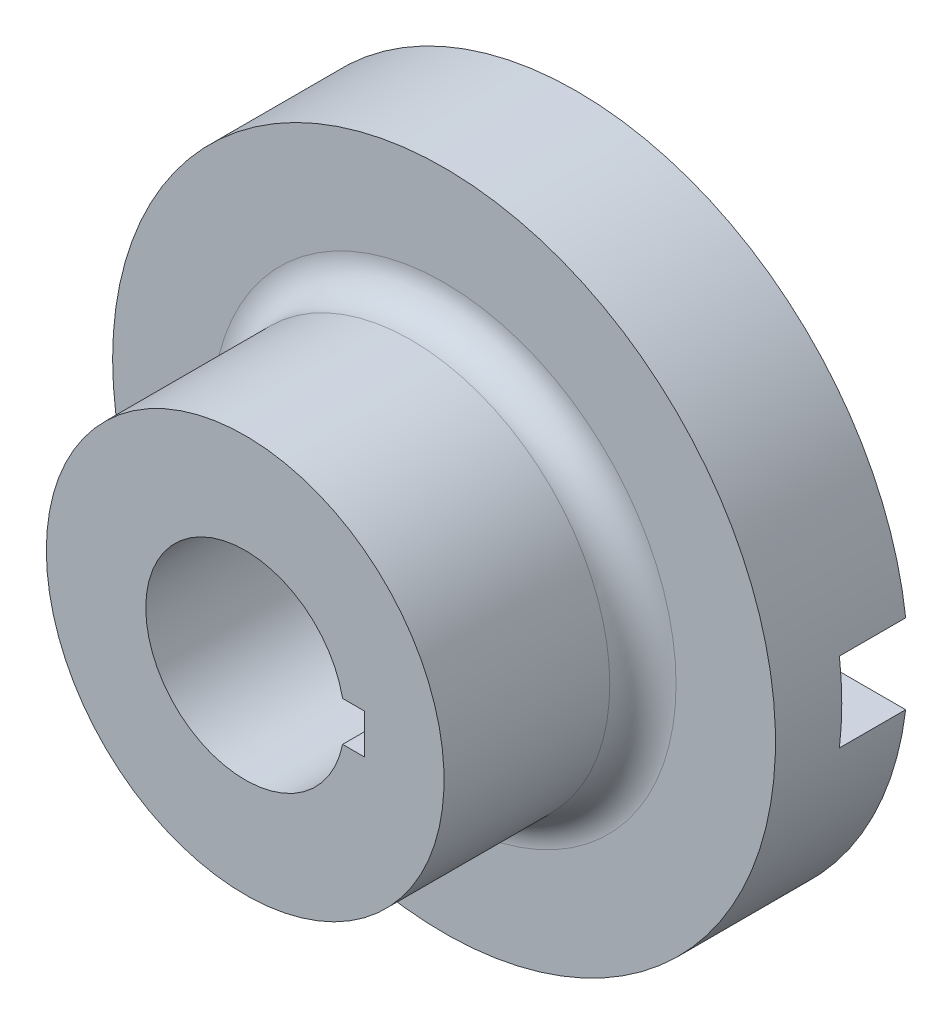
from build123d import *

# Parameters (mm, degrees)
SKETCH2_W          = 100
SKETCH2_H          = 12
CUT_EXTRUDE1_DEPTH = 10
SKETCH3_W          = 4
SKETCH3_H          = 6
CUT_EXTRUDE3_DEPTH = 87.602540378
FILLET1_R          = 5


with BuildPart() as part:
    # Sketch1 → Revolve1 (revolve)
    with BuildSketch(Plane(origin=(0, 0, 0), x_dir=(0, 0, -1), z_dir=(1, 0, 0)), mode=Mode.PRIVATE) as revolve1_sk:
        Polygon((0, 15), (0, 50), (-20, 50), (-20, 30), (-50, 30), (-50, 15), align=None)
    revolve(revolve1_sk.sketch.rotate(Axis((0, 0, 0), (0, 0, 1)), 90), axis=Axis((0, 0, 0), (0, 0, 1)))

    # Sketch2 → Cut-Extrude1 (cut)
    with BuildSketch(Plane(origin=(0, 0, 0), x_dir=(-1, 0, 0), z_dir=(0, 0, -1))):
        Rectangle(SKETCH2_W, SKETCH2_H)
    extrude(amount=-CUT_EXTRUDE1_DEPTH, mode=Mode.SUBTRACT)

    # Sketch3 → Cut-Extrude3 (cut, through all)
    with BuildSketch(Plane.XY.offset(50)):
        with Locations((16, 0)):
            Rectangle(SKETCH3_W, SKETCH3_H)
    extrude(amount=-CUT_EXTRUDE3_DEPTH, mode=Mode.SUBTRACT)

    # Fillet1
    fillet1_edges = [part.edges().sort_by_distance(p)[0] for p in [
        (30, 0, 20),
    ]]
    fillet(fillet1_edges, radius=FILLET1_R)


solid = part.part
